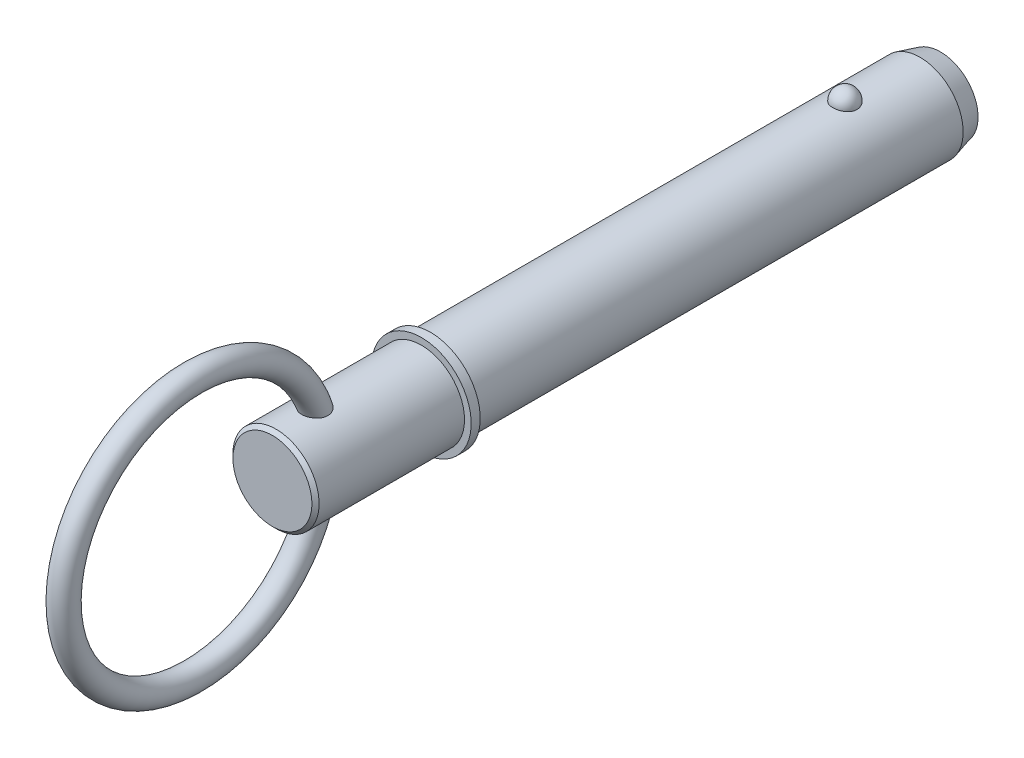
ISO-10303-21;
HEADER;
FILE_DESCRIPTION(('STEP AP214'),'2;1');
FILE_NAME('part.step','',(''),(''),'','','');
FILE_SCHEMA(('AUTOMOTIVE_DESIGN { 1 0 10303 214 1 1 1 1 }'));
ENDSEC;
DATA;
#1=APPLICATION_CONTEXT('core data for automotive mechanical design processes');
#2=APPLICATION_PROTOCOL_DEFINITION('international standard','automotive_design',2000,#1);
#3=PRODUCT_CONTEXT('',#1,'mechanical');
#4=PRODUCT('Part','Part','',(#3));
#5=PRODUCT_RELATED_PRODUCT_CATEGORY('part','',(#4));
#6=PRODUCT_DEFINITION_FORMATION('','',#4);
#7=PRODUCT_DEFINITION_CONTEXT('part definition',#1,'design');
#8=PRODUCT_DEFINITION('design','',#6,#7);
#9=PRODUCT_DEFINITION_SHAPE('','',#8);
#10=(LENGTH_UNIT() NAMED_UNIT(*) SI_UNIT(.MILLI.,.METRE.));
#11=(NAMED_UNIT(*) PLANE_ANGLE_UNIT() SI_UNIT($,.RADIAN.));
#12=(NAMED_UNIT(*) SI_UNIT($,.STERADIAN.) SOLID_ANGLE_UNIT());
#13=UNCERTAINTY_MEASURE_WITH_UNIT(LENGTH_MEASURE(1.E-05),#10,'distance_accuracy_value','');
#14=(GEOMETRIC_REPRESENTATION_CONTEXT(3) GLOBAL_UNCERTAINTY_ASSIGNED_CONTEXT((#13)) GLOBAL_UNIT_ASSIGNED_CONTEXT((#10,
#11,#12)) REPRESENTATION_CONTEXT('',''));
#15=CARTESIAN_POINT('',(0.,0.,0.));
#16=DIRECTION('',(0.,0.,1.));
#17=DIRECTION('',(1.,0.,0.));
#18=AXIS2_PLACEMENT_3D('',#15,#16,#17);
#19=CARTESIAN_POINT('',(0.,0.,88.9));
#20=DIRECTION('',(0.,0.,-1.));
#21=DIRECTION('',(-1.,0.,0.));
#22=AXIS2_PLACEMENT_3D('',#19,#20,#21);
#23=CYLINDRICAL_SURFACE('',#22,9.525);
#24=CARTESIAN_POINT('',(2.66304631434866,9.14515223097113,-2.69));
#25=CARTESIAN_POINT('',(2.66304388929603,9.14515434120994,-2.53964785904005));
#26=CARTESIAN_POINT('',(2.65079171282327,9.14874785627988,-2.389265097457));
#27=CARTESIAN_POINT('',(2.60207590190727,9.16272073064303,-2.09276319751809));
#28=CARTESIAN_POINT('',(2.5656035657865,9.17310252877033,-1.94664561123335));
#29=CARTESIAN_POINT('',(2.469373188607,9.19947238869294,-1.66290124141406));
#30=CARTESIAN_POINT('',(2.40962536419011,9.215457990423,-1.52527076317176));
#31=CARTESIAN_POINT('',(2.26832639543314,9.25124900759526,-1.26225231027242));
#32=CARTESIAN_POINT('',(2.1867756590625,9.27105435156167,-1.1368641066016));
#33=CARTESIAN_POINT('',(2.00344089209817,9.3123948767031,-0.901158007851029));
#34=CARTESIAN_POINT('',(1.90155748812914,9.33393823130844,-0.790918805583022));
#35=CARTESIAN_POINT('',(1.68043702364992,9.37626794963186,-0.589299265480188));
#36=CARTESIAN_POINT('',(1.56119995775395,9.397054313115,-0.497918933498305));
#37=CARTESIAN_POINT('',(1.30893044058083,9.43549335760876,-0.33681251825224));
#38=CARTESIAN_POINT('',(1.17593917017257,9.45315498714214,-0.267024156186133));
#39=CARTESIAN_POINT('',(0.8995966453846,9.48344056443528,-0.150749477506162));
#40=CARTESIAN_POINT('',(0.756246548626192,9.49606507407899,-0.104260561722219));
#41=CARTESIAN_POINT('',(0.466048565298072,9.51468193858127,-0.0365733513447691));
#42=CARTESIAN_POINT('',(0.319312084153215,9.52079100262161,-0.0149294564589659));
#43=CARTESIAN_POINT('',(0.0241592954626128,9.52611235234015,0.00395337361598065));
#44=CARTESIAN_POINT('',(-0.124256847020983,9.5253253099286,0.00119468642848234));
#45=CARTESIAN_POINT('',(-0.41628168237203,9.51700443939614,-0.0284230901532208));
#46=CARTESIAN_POINT('',(-0.559928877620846,9.50956858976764,-0.0549321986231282));
#47=CARTESIAN_POINT('',(-0.840604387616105,9.48887888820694,-0.130816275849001));
#48=CARTESIAN_POINT('',(-0.977632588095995,9.47562493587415,-0.180191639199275));
#49=CARTESIAN_POINT('',(-1.24212223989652,9.44460733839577,-0.300803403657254));
#50=CARTESIAN_POINT('',(-1.36952298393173,9.42681774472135,-0.372166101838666));
#51=CARTESIAN_POINT('',(-1.61053183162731,9.38864858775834,-0.53472901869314));
#52=CARTESIAN_POINT('',(-1.72413851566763,9.36826875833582,-0.625931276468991));
#53=CARTESIAN_POINT('',(-1.9367483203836,9.32666137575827,-0.827716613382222));
#54=CARTESIAN_POINT('',(-2.03542624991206,9.3054250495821,-0.93864062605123));
#55=CARTESIAN_POINT('',(-2.21301001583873,9.26480083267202,-1.17562728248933));
#56=CARTESIAN_POINT('',(-2.29191442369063,9.24541307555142,-1.30169101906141));
#57=CARTESIAN_POINT('',(-2.4288038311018,9.21040769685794,-1.56709947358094));
#58=CARTESIAN_POINT('',(-2.48653332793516,9.19483682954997,-1.7065822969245));
#59=CARTESIAN_POINT('',(-2.57830950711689,9.16952722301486,-1.9936348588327));
#60=CARTESIAN_POINT('',(-2.61235688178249,9.1597883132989,-2.14120436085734));
#61=CARTESIAN_POINT('',(-2.65582131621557,9.14728131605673,-2.43957517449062));
#62=CARTESIAN_POINT('',(-2.66534248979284,9.14448376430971,-2.59036007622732));
#63=CARTESIAN_POINT('',(-2.659816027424,9.1460926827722,-2.89143694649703));
#64=CARTESIAN_POINT('',(-2.64476907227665,9.15049895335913,-3.04172892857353));
#65=CARTESIAN_POINT('',(-2.59062526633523,9.16597303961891,-3.33676161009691));
#66=CARTESIAN_POINT('',(-2.55165119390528,9.17700684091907,-3.48152666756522));
#67=CARTESIAN_POINT('',(-2.45072334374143,9.20447158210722,-3.76226728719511));
#68=CARTESIAN_POINT('',(-2.38876863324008,9.22090274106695,-3.89824249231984));
#69=CARTESIAN_POINT('',(-2.24300082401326,9.25744165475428,-4.15838266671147));
#70=CARTESIAN_POINT('',(-2.15906901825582,9.27756919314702,-4.28247834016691));
#71=CARTESIAN_POINT('',(-1.97161008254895,9.31920445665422,-4.51460755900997));
#72=CARTESIAN_POINT('',(-1.86808218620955,9.34071223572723,-4.62264047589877));
#73=CARTESIAN_POINT('',(-1.64365852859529,9.38280712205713,-4.82005417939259));
#74=CARTESIAN_POINT('',(-1.52269814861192,9.40339041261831,-4.90936239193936));
#75=CARTESIAN_POINT('',(-1.26696810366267,9.44124442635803,-5.06628635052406));
#76=CARTESIAN_POINT('',(-1.13219941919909,9.45851538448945,-5.13390363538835));
#77=CARTESIAN_POINT('',(-0.854427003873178,9.48761400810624,-5.24478918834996));
#78=CARTESIAN_POINT('',(-0.711548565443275,9.49950757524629,-5.28835378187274));
#79=CARTESIAN_POINT('',(-0.420167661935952,9.51684639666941,-5.35116010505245));
#80=CARTESIAN_POINT('',(-0.271665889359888,9.52229244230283,-5.3704048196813));
#81=CARTESIAN_POINT('',(0.0236961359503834,9.52609381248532,-5.38387805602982));
#82=CARTESIAN_POINT('',(0.170533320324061,9.52458300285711,-5.37857884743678));
#83=CARTESIAN_POINT('',(0.461166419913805,9.51494050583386,-5.34419624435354));
#84=CARTESIAN_POINT('',(0.604962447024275,9.50680906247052,-5.31511372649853));
#85=CARTESIAN_POINT('',(0.884899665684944,9.48484202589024,-5.23415185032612));
#86=CARTESIAN_POINT('',(1.02106863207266,9.47102889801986,-5.18236222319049));
#87=CARTESIAN_POINT('',(1.28268503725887,9.43915933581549,-5.05742910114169));
#88=CARTESIAN_POINT('',(1.40813178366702,9.421102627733,-4.98428422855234));
#89=CARTESIAN_POINT('',(1.64690915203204,9.38233399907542,-4.81729201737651));
#90=CARTESIAN_POINT('',(1.76002050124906,9.36158508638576,-4.72313982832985));
#91=CARTESIAN_POINT('',(1.96897358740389,9.31987907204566,-4.5173244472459));
#92=CARTESIAN_POINT('',(2.06481234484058,9.29892193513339,-4.40565824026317));
#93=CARTESIAN_POINT('',(2.23837433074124,9.25869342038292,-4.16566572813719));
#94=CARTESIAN_POINT('',(2.31574652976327,9.23945848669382,-4.03707931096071));
#95=CARTESIAN_POINT('',(2.44818540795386,9.20525491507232,-3.76840633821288));
#96=CARTESIAN_POINT('',(2.50325979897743,9.19028480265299,-3.62832377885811));
#97=CARTESIAN_POINT('',(2.58510224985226,9.16757716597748,-3.35610038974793));
#98=CARTESIAN_POINT('',(2.61427951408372,9.15923447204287,-3.22472833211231));
#99=CARTESIAN_POINT('',(2.6532524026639,9.14802112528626,-2.95891229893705));
#100=CARTESIAN_POINT('',(2.66304848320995,9.1451503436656,-2.82446839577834));
#101=CARTESIAN_POINT('',(2.66304631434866,9.14515223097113,-2.69));
#102=B_SPLINE_CURVE_WITH_KNOTS('',3,(#24,#25,#26,#27,#28,#29,#30,#31,#32,#33,#34,#35,#36,#37,
#38,#39,#40,#41,#42,#43,#44,#45,#46,#47,#48,#49,#50,#51,#52,#53,#54,#55,#56,#57,#58,#59,#60,#61,
#62,#63,#64,#65,#66,#67,#68,#69,#70,#71,#72,#73,#74,#75,#76,#77,#78,#79,#80,#81,#82,#83,#84,#85,
#86,#87,#88,#89,#90,#91,#92,#93,#94,#95,#96,#97,#98,#99,#100,#101),.UNSPECIFIED.,.T.,.F.,(4,2,2,
2,2,2,2,2,2,2,2,2,2,2,2,2,2,2,2,2,2,2,2,2,2,2,2,2,2,2,2,2,2,2,2,2,2,2,4),(0.,0.450573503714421,
0.901308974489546,1.35184682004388,1.80237623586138,2.25516399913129,2.70795190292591,
3.15942136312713,3.61084044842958,4.0540301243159,4.49717661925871,4.9338984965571,
5.37062791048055,5.80991423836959,6.24924573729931,6.69708004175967,7.1449466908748,
7.5980522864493,8.0511446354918,8.50231041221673,8.95346368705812,9.40232106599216,
9.85119666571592,10.3025487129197,10.7539184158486,11.2070064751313,11.6600623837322,
12.1074045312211,12.5546917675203,12.9934085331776,13.4321091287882,13.8690915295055,
14.3061021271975,14.7499227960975,15.1938199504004,15.6455814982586,16.0971866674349,
16.5001694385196,16.9031427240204),.UNSPECIFIED.);
#103=CARTESIAN_POINT('',(2.66304631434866,9.14515223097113,-2.69));
#104=VERTEX_POINT('',#103);
#105=EDGE_CURVE('E101',#104,#104,#102,.T.);
#106=ORIENTED_EDGE('',*,*,#105,.T.);
#107=EDGE_LOOP('',(#106));
#108=FACE_BOUND('',#107,.T.);
#109=CARTESIAN_POINT('',(0.,0.,-19.2999999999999));
#110=DIRECTION('',(0.,0.,-1.));
#111=DIRECTION('',(-1.,0.,0.));
#112=AXIS2_PLACEMENT_3D('',#109,#110,#111);
#113=CIRCLE('',#112,9.525);
#114=CARTESIAN_POINT('',(-9.525,0.,-19.2999999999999));
#115=VERTEX_POINT('',#114);
#116=EDGE_CURVE('E109',#115,#115,#113,.F.);
#117=ORIENTED_EDGE('',*,*,#116,.T.);
#118=EDGE_LOOP('',(#117));
#119=FACE_BOUND('',#118,.T.);
#120=CARTESIAN_POINT('',(0.,0.,88.9));
#121=DIRECTION('',(0.,0.,1.));
#122=DIRECTION('',(1.,0.,0.));
#123=AXIS2_PLACEMENT_3D('',#120,#121,#122);
#124=CIRCLE('',#123,9.525);
#125=CARTESIAN_POINT('',(9.525,0.,88.9));
#126=VERTEX_POINT('',#125);
#127=EDGE_CURVE('E107',#126,#126,#124,.T.);
#128=ORIENTED_EDGE('',*,*,#127,.F.);
#129=EDGE_LOOP('',(#128));
#130=FACE_BOUND('',#129,.T.);
#131=ADVANCED_FACE('F39',(#108,#119,#130),#23,.T.);
#132=CARTESIAN_POINT('',(0.,0.,-23.8));
#133=DIRECTION('',(0.,0.,-1.));
#134=DIRECTION('',(-1.,0.,0.));
#135=AXIS2_PLACEMENT_3D('',#132,#133,#134);
#136=PLANE('',#135);
#137=CARTESIAN_POINT('',(0.,0.,-23.8));
#138=DIRECTION('',(0.,0.,-1.));
#139=DIRECTION('',(-1.,0.,0.));
#140=AXIS2_PLACEMENT_3D('',#137,#138,#139);
#141=CIRCLE('',#140,8.31922863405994);
#142=CARTESIAN_POINT('',(-8.31922863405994,0.,-23.8));
#143=VERTEX_POINT('',#142);
#144=EDGE_CURVE('E142',#143,#143,#141,.T.);
#145=ORIENTED_EDGE('',*,*,#144,.T.);
#146=EDGE_LOOP('',(#145));
#147=FACE_BOUND('',#146,.T.);
#148=ADVANCED_FACE('F87',(#147),#136,.T.);
#149=CARTESIAN_POINT('',(0.,0.,-23.8));
#150=DIRECTION('',(0.,0.,1.));
#151=DIRECTION('',(1.,0.,0.));
#152=AXIS2_PLACEMENT_3D('',#149,#150,#151);
#153=CONICAL_SURFACE('',#152,8.31922863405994,0.261799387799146);
#154=ORIENTED_EDGE('',*,*,#116,.F.);
#155=EDGE_LOOP('',(#154));
#156=FACE_BOUND('',#155,.T.);
#157=ORIENTED_EDGE('',*,*,#144,.F.);
#158=EDGE_LOOP('',(#157));
#159=FACE_BOUND('',#158,.T.);
#160=ADVANCED_FACE('F93',(#156,#159),#153,.T.);
#161=CARTESIAN_POINT('',(0.,9.525,-2.69));
#162=DIRECTION('',(0.,1.,0.));
#163=DIRECTION('',(0.,0.,1.));
#164=AXIS2_PLACEMENT_3D('',#161,#162,#163);
#165=SPHERICAL_SURFACE('',#164,2.69);
#166=ORIENTED_EDGE('',*,*,#105,.F.);
#167=EDGE_LOOP('',(#166));
#168=FACE_BOUND('',#167,.T.);
#169=ADVANCED_FACE('F112',(#168),#165,.T.);
#170=CARTESIAN_POINT('',(0.,0.,88.9));
#171=DIRECTION('',(0.,0.,-1.));
#172=DIRECTION('',(-1.,0.,0.));
#173=AXIS2_PLACEMENT_3D('',#170,#171,#172);
#174=PLANE('',#173);
#175=ORIENTED_EDGE('',*,*,#127,.T.);
#176=EDGE_LOOP('',(#175));
#177=FACE_BOUND('',#176,.T.);
#178=CARTESIAN_POINT('',(0.,0.,88.9));
#179=DIRECTION('',(0.,0.,-1.));
#180=DIRECTION('',(-1.,0.,0.));
#181=AXIS2_PLACEMENT_3D('',#178,#179,#180);
#182=CIRCLE('',#181,11.);
#183=CARTESIAN_POINT('',(-11.,0.,88.9));
#184=VERTEX_POINT('',#183);
#185=EDGE_CURVE('E108',#184,#184,#182,.T.);
#186=ORIENTED_EDGE('',*,*,#185,.T.);
#187=EDGE_LOOP('',(#186));
#188=FACE_BOUND('',#187,.T.);
#189=ADVANCED_FACE('F116',(#177,#188),#174,.T.);
#190=CARTESIAN_POINT('',(0.,0.,33.7287874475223));
#191=DIRECTION('',(0.,0.,-1.));
#192=DIRECTION('',(-1.,0.,0.));
#193=AXIS2_PLACEMENT_3D('',#190,#191,#192);
#194=CYLINDRICAL_SURFACE('',#193,11.);
#195=CARTESIAN_POINT('',(0.,0.,90.9));
#196=DIRECTION('',(0.,0.,-1.));
#197=DIRECTION('',(-1.,0.,0.));
#198=AXIS2_PLACEMENT_3D('',#195,#196,#197);
#199=CIRCLE('',#198,11.);
#200=CARTESIAN_POINT('',(-11.,0.,90.9));
#201=VERTEX_POINT('',#200);
#202=EDGE_CURVE('E133',#201,#201,#199,.T.);
#203=ORIENTED_EDGE('',*,*,#202,.T.);
#204=EDGE_LOOP('',(#203));
#205=FACE_BOUND('',#204,.T.);
#206=ORIENTED_EDGE('',*,*,#185,.F.);
#207=EDGE_LOOP('',(#206));
#208=FACE_BOUND('',#207,.T.);
#209=ADVANCED_FACE('F120',(#205,#208),#194,.T.);
#210=CARTESIAN_POINT('',(0.,11.,90.9));
#211=DIRECTION('',(0.,0.,1.));
#212=DIRECTION('',(1.,0.,0.));
#213=AXIS2_PLACEMENT_3D('',#210,#211,#212);
#214=PLANE('',#213);
#215=CARTESIAN_POINT('',(0.,0.,90.9));
#216=DIRECTION('',(0.,0.,1.));
#217=DIRECTION('',(1.,0.,0.));
#218=AXIS2_PLACEMENT_3D('',#215,#216,#217);
#219=CIRCLE('',#218,9.525);
#220=CARTESIAN_POINT('',(9.525,0.,90.9));
#221=VERTEX_POINT('',#220);
#222=EDGE_CURVE('E111',#221,#221,#219,.T.);
#223=ORIENTED_EDGE('',*,*,#222,.F.);
#224=EDGE_LOOP('',(#223));
#225=FACE_BOUND('',#224,.T.);
#226=ORIENTED_EDGE('',*,*,#202,.F.);
#227=EDGE_LOOP('',(#226));
#228=FACE_BOUND('',#227,.T.);
#229=ADVANCED_FACE('F84',(#225,#228),#214,.T.);
#230=CARTESIAN_POINT('',(0.,0.,123.83));
#231=DIRECTION('',(0.,0.,-1.));
#232=DIRECTION('',(-1.,0.,0.));
#233=AXIS2_PLACEMENT_3D('',#230,#231,#232);
#234=CYLINDRICAL_SURFACE('',#233,9.525);
#235=CARTESIAN_POINT('',(-1.17255022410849,-9.45255262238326,111.815681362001));
#236=CARTESIAN_POINT('',(-1.03279041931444,-9.46988901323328,111.752058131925));
#237=CARTESIAN_POINT('',(-0.887457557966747,-9.48474288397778,111.700036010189));
#238=CARTESIAN_POINT('',(-0.589790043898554,-9.50789357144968,111.620301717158));
#239=CARTESIAN_POINT('',(-0.437456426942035,-9.51619135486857,111.592585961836));
#240=CARTESIAN_POINT('',(-0.130095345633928,-9.52535230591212,111.562037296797));
#241=CARTESIAN_POINT('',(0.0249321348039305,-9.52621542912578,111.559204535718));
#242=CARTESIAN_POINT('',(0.333291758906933,-9.5204161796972,111.578480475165));
#243=CARTESIAN_POINT('',(0.486623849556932,-9.51375357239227,111.600589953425));
#244=CARTESIAN_POINT('',(0.787326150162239,-9.49360162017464,111.669309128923));
#245=CARTESIAN_POINT('',(0.934692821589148,-9.48010828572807,111.715933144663));
#246=CARTESIAN_POINT('',(1.2191706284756,-9.44773819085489,111.832695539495));
#247=CARTESIAN_POINT('',(1.35628163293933,-9.42886136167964,111.902834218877));
#248=CARTESIAN_POINT('',(1.61597534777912,-9.38783836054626,112.064858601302));
#249=CARTESIAN_POINT('',(1.73859309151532,-9.36570037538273,112.156690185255));
#250=CARTESIAN_POINT('',(1.96611924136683,-9.32059424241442,112.359983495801));
#251=CARTESIAN_POINT('',(2.07103000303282,-9.29762620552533,112.471442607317));
#252=CARTESIAN_POINT('',(2.25895856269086,-9.25375378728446,112.709567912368));
#253=CARTESIAN_POINT('',(2.34223089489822,-9.23282741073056,112.836029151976));
#254=CARTESIAN_POINT('',(2.48638570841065,-9.19505802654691,113.101654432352));
#255=CARTESIAN_POINT('',(2.54727152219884,-9.17821441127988,113.240816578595));
#256=CARTESIAN_POINT('',(2.64504150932,-9.15051673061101,113.526450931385));
#257=CARTESIAN_POINT('',(2.68213620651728,-9.13961026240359,113.67284631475));
#258=CARTESIAN_POINT('',(2.73308631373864,-9.1245038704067,113.969935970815));
#259=CARTESIAN_POINT('',(2.74693762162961,-9.12030513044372,114.120630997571));
#260=CARTESIAN_POINT('',(2.75225289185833,-9.11870262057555,114.428204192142));
#261=CARTESIAN_POINT('',(2.742835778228,-9.12156626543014,114.585097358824));
#262=CARTESIAN_POINT('',(2.70120500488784,-9.13397864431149,114.89553038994));
#263=CARTESIAN_POINT('',(2.66898313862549,-9.14352978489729,115.049069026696));
#264=CARTESIAN_POINT('',(2.57915721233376,-9.1692947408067,115.364317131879));
#265=CARTESIAN_POINT('',(2.5193838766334,-9.18606757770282,115.52536274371));
#266=CARTESIAN_POINT('',(2.37615490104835,-9.22415241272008,115.836112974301));
#267=CARTESIAN_POINT('',(2.29267648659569,-9.2454687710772,115.985806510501));
#268=CARTESIAN_POINT('',(2.09570343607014,-9.29218719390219,116.282005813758));
#269=CARTESIAN_POINT('',(1.98029238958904,-9.31778152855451,116.427215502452));
#270=CARTESIAN_POINT('',(1.72523060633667,-9.36835235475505,116.694631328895));
#271=CARTESIAN_POINT('',(1.58560973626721,-9.39332956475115,116.81686542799));
#272=CARTESIAN_POINT('',(1.31999418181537,-9.43381163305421,117.006542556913));
#273=CARTESIAN_POINT('',(1.1984987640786,-9.45016352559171,117.080111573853));
#274=CARTESIAN_POINT('',(0.944726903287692,-9.47889043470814,117.206555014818));
#275=CARTESIAN_POINT('',(0.812460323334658,-9.4912690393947,117.25944811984));
#276=CARTESIAN_POINT('',(0.539385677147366,-9.51070487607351,117.341579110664));
#277=CARTESIAN_POINT('',(0.398529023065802,-9.51772807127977,117.370665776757));
#278=CARTESIAN_POINT('',(0.113692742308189,-9.52538430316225,117.40234627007));
#279=CARTESIAN_POINT('',(-0.0302854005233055,-9.52602031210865,117.404952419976));
#280=CARTESIAN_POINT('',(-0.30106744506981,-9.52110324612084,117.384638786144));
#281=CARTESIAN_POINT('',(-0.428091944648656,-9.51619084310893,117.364361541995));
#282=CARTESIAN_POINT('',(-0.676960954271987,-9.50173118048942,117.303770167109));
#283=CARTESIAN_POINT('',(-0.798804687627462,-9.49218322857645,117.263453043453));
#284=CARTESIAN_POINT('',(-1.03743276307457,-9.4691126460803,117.163797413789));
#285=CARTESIAN_POINT('',(-1.15402581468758,-9.45550022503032,117.104026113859));
#286=CARTESIAN_POINT('',(-1.37707059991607,-9.42560278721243,116.968465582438));
#287=CARTESIAN_POINT('',(-1.48351822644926,-9.40931669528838,116.892669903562));
#288=CARTESIAN_POINT('',(-1.70022776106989,-9.37276249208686,116.715206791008));
#289=CARTESIAN_POINT('',(-1.80866644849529,-9.35226352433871,116.611363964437));
#290=CARTESIAN_POINT('',(-2.00947431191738,-9.31118474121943,116.38916467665));
#291=CARTESIAN_POINT('',(-2.1018320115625,-9.2906048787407,116.270797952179));
#292=CARTESIAN_POINT('',(-2.28343646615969,-9.24779116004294,116.001723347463));
#293=CARTESIAN_POINT('',(-2.36963977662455,-9.22584708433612,115.848904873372));
#294=CARTESIAN_POINT('',(-2.51731958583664,-9.18665215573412,115.531108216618));
#295=CARTESIAN_POINT('',(-2.57878214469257,-9.16940395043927,115.366123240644));
#296=CARTESIAN_POINT('',(-2.67771284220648,-9.14102404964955,115.017906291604));
#297=CARTESIAN_POINT('',(-2.71355979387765,-9.13031106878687,114.834171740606));
#298=CARTESIAN_POINT('',(-2.75239325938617,-9.11868499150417,114.462939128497));
#299=CARTESIAN_POINT('',(-2.75540326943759,-9.11776488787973,114.275443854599));
#300=CARTESIAN_POINT('',(-2.72755769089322,-9.12612848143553,113.918233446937));
#301=CARTESIAN_POINT('',(-2.69938579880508,-9.1346036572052,113.748293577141));
#302=CARTESIAN_POINT('',(-2.6128234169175,-9.15973790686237,113.41694195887));
#303=CARTESIAN_POINT('',(-2.55445306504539,-9.17639152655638,113.255524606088));
#304=CARTESIAN_POINT('',(-2.41575064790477,-9.21381352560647,112.962262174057));
#305=CARTESIAN_POINT('',(-2.33810564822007,-9.23402440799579,112.829067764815));
#306=CARTESIAN_POINT('',(-2.16110598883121,-9.27704240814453,112.578436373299));
#307=CARTESIAN_POINT('',(-2.06174995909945,-9.29984968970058,112.46100038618));
#308=CARTESIAN_POINT('',(-1.84046167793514,-9.34620233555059,112.241444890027));
#309=CARTESIAN_POINT('',(-1.71787459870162,-9.36974632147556,112.13998498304));
#310=CARTESIAN_POINT('',(-1.45637301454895,-9.41393415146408,111.960085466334));
#311=CARTESIAN_POINT('',(-1.31745717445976,-9.43457775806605,111.881647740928));
#312=CARTESIAN_POINT('',(-1.17255022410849,-9.45255262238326,111.815681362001));
#313=B_SPLINE_CURVE_WITH_KNOTS('',3,(#235,#236,#237,#238,#239,#240,#241,#242,#243,#244,#245,
#246,#247,#248,#249,#250,#251,#252,#253,#254,#255,#256,#257,#258,#259,#260,#261,#262,#263,#264,
#265,#266,#267,#268,#269,#270,#271,#272,#273,#274,#275,#276,#277,#278,#279,#280,#281,#282,#283,
#284,#285,#286,#287,#288,#289,#290,#291,#292,#293,#294,#295,#296,#297,#298,#299,#300,#301,#302,
#303,#304,#305,#306,#307,#308,#309,#310,#311,#312),.UNSPECIFIED.,.T.,.F.,(4,2,2,2,2,2,2,2,2,2,2,
2,2,2,2,2,2,2,2,2,2,2,2,2,2,2,2,2,2,2,2,2,2,2,2,2,2,2,4),(0.,0.463035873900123,
0.926003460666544,1.38897381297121,1.85195860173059,2.31521411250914,2.77847553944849,
3.24059321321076,3.70264936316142,4.15899535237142,4.61527338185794,5.06745604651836,
5.51971850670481,5.98936669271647,6.45918397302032,6.9748286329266,7.49097038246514,
8.04995658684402,8.60825803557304,9.03545685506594,9.46226879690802,9.89177127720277,
10.3210738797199,10.7054535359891,11.0898906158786,11.4835430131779,11.8773540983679,
12.3302409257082,12.7834496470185,13.3116493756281,13.8401462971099,14.3996817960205,
14.9588168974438,15.4733264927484,15.9874934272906,16.4516692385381,16.915874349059,
17.3959238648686,17.8760126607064),.UNSPECIFIED.);
#314=CARTESIAN_POINT('',(-1.17255022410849,-9.45255262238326,111.815681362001));
#315=VERTEX_POINT('',#314);
#316=EDGE_CURVE('E10',#315,#315,#313,.T.);
#317=ORIENTED_EDGE('',*,*,#316,.F.);
#318=EDGE_LOOP('',(#317));
#319=FACE_BOUND('',#318,.T.);
#320=CARTESIAN_POINT('',(-1.17255022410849,9.45255262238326,111.815681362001));
#321=CARTESIAN_POINT('',(-1.31058061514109,9.43543238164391,111.878514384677));
#322=CARTESIAN_POINT('',(-1.44315063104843,9.41589375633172,111.952651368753));
#323=CARTESIAN_POINT('',(-1.69365345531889,9.37407591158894,112.121892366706));
#324=CARTESIAN_POINT('',(-1.81158925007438,9.35179725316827,112.216992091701));
#325=CARTESIAN_POINT('',(-2.02956633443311,9.30692788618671,112.42596768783));
#326=CARTESIAN_POINT('',(-2.12959463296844,9.28433696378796,112.539857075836));
#327=CARTESIAN_POINT('',(-2.30883055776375,9.24139869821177,112.78334578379));
#328=CARTESIAN_POINT('',(-2.38804080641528,9.22105107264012,112.912943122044));
#329=CARTESIAN_POINT('',(-2.52289811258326,9.18506690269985,113.182637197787));
#330=CARTESIAN_POINT('',(-2.57879510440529,9.16938093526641,113.322602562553));
#331=CARTESIAN_POINT('',(-2.66732862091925,9.14402087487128,113.610194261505));
#332=CARTESIAN_POINT('',(-2.6999643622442,9.13434698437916,113.757820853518));
#333=CARTESIAN_POINT('',(-2.74234854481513,9.12171311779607,114.058709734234));
#334=CARTESIAN_POINT('',(-2.75176419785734,9.11885078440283,114.212022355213));
#335=CARTESIAN_POINT('',(-2.74768995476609,9.12007747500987,114.518282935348));
#336=CARTESIAN_POINT('',(-2.73419331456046,9.12416854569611,114.671230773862));
#337=CARTESIAN_POINT('',(-2.68381401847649,9.13911977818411,114.985048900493));
#338=CARTESIAN_POINT('',(-2.64520186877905,9.15047943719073,115.145615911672));
#339=CARTESIAN_POINT('',(-2.54485320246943,9.17889121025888,115.458878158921));
#340=CARTESIAN_POINT('',(-2.48309922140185,9.19594762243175,115.611567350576));
#341=CARTESIAN_POINT('',(-2.33056913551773,9.23584987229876,115.921122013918));
#342=CARTESIAN_POINT('',(-2.23745101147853,9.25911216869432,116.076784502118));
#343=CARTESIAN_POINT('',(-2.02674425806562,9.307501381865,116.370279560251));
#344=CARTESIAN_POINT('',(-1.90916388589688,9.33262766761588,116.508118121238));
#345=CARTESIAN_POINT('',(-1.67044606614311,9.37804498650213,116.742015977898));
#346=CARTESIAN_POINT('',(-1.55243875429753,9.39849934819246,116.841240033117));
#347=CARTESIAN_POINT('',(-1.30125310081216,9.43654625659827,117.019193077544));
#348=CARTESIAN_POINT('',(-1.16808326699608,9.45414039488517,117.097933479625));
#349=CARTESIAN_POINT('',(-0.958516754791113,9.47691412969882,117.197606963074));
#350=CARTESIAN_POINT('',(-0.886649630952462,9.48392776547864,117.227860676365));
#351=CARTESIAN_POINT('',(-0.740281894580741,9.49647248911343,117.281484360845));
#352=CARTESIAN_POINT('',(-0.665782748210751,9.50200438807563,117.304858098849));
#353=CARTESIAN_POINT('',(-0.514804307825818,9.51137811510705,117.3442294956));
#354=CARTESIAN_POINT('',(-0.438326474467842,9.51522115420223,117.360232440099));
#355=CARTESIAN_POINT('',(-0.284116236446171,9.52107513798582,117.384532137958));
#356=CARTESIAN_POINT('',(-0.206384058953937,9.52308641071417,117.392830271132));
#357=CARTESIAN_POINT('',(0.00463957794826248,9.5259225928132,117.40454519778));
#358=CARTESIAN_POINT('',(0.138460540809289,9.52491109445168,117.400394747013));
#359=CARTESIAN_POINT('',(0.403152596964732,9.51738801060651,117.369251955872));
#360=CARTESIAN_POINT('',(0.534023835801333,9.51087669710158,117.342260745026));
#361=CARTESIAN_POINT('',(0.783985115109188,9.49347484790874,117.268806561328));
#362=CARTESIAN_POINT('',(0.903337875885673,9.48277338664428,117.223181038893));
#363=CARTESIAN_POINT('',(1.13363663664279,9.45800893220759,117.114928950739));
#364=CARTESIAN_POINT('',(1.24458027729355,9.44394500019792,117.052297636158));
#365=CARTESIAN_POINT('',(1.46880911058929,9.41182796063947,116.904389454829));
#366=CARTESIAN_POINT('',(1.58087386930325,9.3935013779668,116.817328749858));
#367=CARTESIAN_POINT('',(1.79132420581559,9.35565274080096,116.628247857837));
#368=CARTESIAN_POINT('',(1.88970126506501,9.33612995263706,116.526218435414));
#369=CARTESIAN_POINT('',(2.08778125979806,9.29401761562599,116.290997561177));
#370=CARTESIAN_POINT('',(2.18473298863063,9.27148591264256,116.15547341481));
#371=CARTESIAN_POINT('',(2.35733954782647,9.22911075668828,115.871030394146));
#372=CARTESIAN_POINT('',(2.43297838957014,9.20926932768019,115.722101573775));
#373=CARTESIAN_POINT('',(2.56843139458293,9.17247322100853,115.397269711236));
#374=CARTESIAN_POINT('',(2.6256192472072,9.15606955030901,115.220196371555));
#375=CARTESIAN_POINT('',(2.70930664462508,9.13166037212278,114.858330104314));
#376=CARTESIAN_POINT('',(2.73581406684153,9.12365270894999,114.673539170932));
#377=CARTESIAN_POINT('',(2.7551261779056,9.11784049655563,114.309017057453));
#378=CARTESIAN_POINT('',(2.74917791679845,9.11965839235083,114.129361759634));
#379=CARTESIAN_POINT('',(2.70473277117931,9.13294027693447,113.774499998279));
#380=CARTESIAN_POINT('',(2.66626406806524,9.14439591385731,113.599289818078));
#381=CARTESIAN_POINT('',(2.56263844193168,9.17393184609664,113.278469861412));
#382=CARTESIAN_POINT('',(2.50080069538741,9.19116614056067,113.131704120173));
#383=CARTESIAN_POINT('',(2.3524484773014,9.23024728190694,112.85189992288));
#384=CARTESIAN_POINT('',(2.26593972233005,9.25209305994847,112.718858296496));
#385=CARTESIAN_POINT('',(2.07585352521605,9.29652853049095,112.477145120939));
#386=CARTESIAN_POINT('',(1.97340753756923,9.31901931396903,112.367562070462));
#387=CARTESIAN_POINT('',(1.75142335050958,9.36327537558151,112.167179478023));
#388=CARTESIAN_POINT('',(1.63188535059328,9.38504066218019,112.076379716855));
#389=CARTESIAN_POINT('',(1.37826267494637,9.42563474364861,111.915168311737));
#390=CARTESIAN_POINT('',(1.24409194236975,9.44444438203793,111.844887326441));
#391=CARTESIAN_POINT('',(0.965562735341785,9.47697010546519,111.726996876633));
#392=CARTESIAN_POINT('',(0.821203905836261,9.4906860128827,111.679388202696));
#393=CARTESIAN_POINT('',(0.524366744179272,9.51173338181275,111.607369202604));
#394=CARTESIAN_POINT('',(0.37180751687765,9.5189799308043,111.583267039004));
#395=CARTESIAN_POINT('',(0.064611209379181,9.52602042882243,111.559842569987));
#396=CARTESIAN_POINT('',(-0.0900262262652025,9.52581308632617,111.560524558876));
#397=CARTESIAN_POINT('',(-0.404139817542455,9.51777767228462,111.587276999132));
#398=CARTESIAN_POINT('',(-0.563508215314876,9.50959696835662,111.614522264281));
#399=CARTESIAN_POINT('',(-0.874799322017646,9.48602809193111,111.695533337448));
#400=CARTESIAN_POINT('',(-1.02672214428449,9.47064002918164,111.74929874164));
#401=CARTESIAN_POINT('',(-1.17255022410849,9.45255262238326,111.815681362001));
#402=B_SPLINE_CURVE_WITH_KNOTS('',3,(#320,#321,#322,#323,#324,#325,#326,#327,#328,#329,#330,
#331,#332,#333,#334,#335,#336,#337,#338,#339,#340,#341,#342,#343,#344,#345,#346,#347,#348,#349,
#350,#351,#352,#353,#354,#355,#356,#357,#358,#359,#360,#361,#362,#363,#364,#365,#366,#367,#368,
#369,#370,#371,#372,#373,#374,#375,#376,#377,#378,#379,#380,#381,#382,#383,#384,#385,#386,#387,
#388,#389,#390,#391,#392,#393,#394,#395,#396,#397,#398,#399,#400,#401),.UNSPECIFIED.,.T.,.F.,(4,
2,2,2,2,2,2,2,2,2,2,2,2,2,2,2,2,2,2,2,2,2,2,2,2,2,2,2,2,2,2,2,2,2,2,2,2,2,2,2,4),(0.,
0.457306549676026,0.914519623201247,1.37206305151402,1.82954881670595,2.28199545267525,
2.73445732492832,3.19336710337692,3.65241198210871,4.14699278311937,4.64194758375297,
5.18812269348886,5.73411374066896,6.19889752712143,6.66342179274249,6.89799214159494,
7.1324338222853,7.36670711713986,7.60093844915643,8.00032434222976,8.39969048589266,
8.78279802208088,9.16601265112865,9.59366701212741,10.0215863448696,10.5240084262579,
11.0268064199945,11.5844522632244,12.1419548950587,12.6781910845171,13.213963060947,
13.6920531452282,14.1700325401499,14.6229745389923,15.0759112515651,15.5316722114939,
15.9874490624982,16.4491237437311,16.9108784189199,17.3940267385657,17.8771677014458),.UNSPECIFIED.);
#403=CARTESIAN_POINT('',(-1.17255022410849,9.45255262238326,111.815681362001));
#404=VERTEX_POINT('',#403);
#405=EDGE_CURVE('E51',#404,#404,#402,.T.);
#406=ORIENTED_EDGE('',*,*,#405,.F.);
#407=EDGE_LOOP('',(#406));
#408=FACE_BOUND('',#407,.T.);
#409=CARTESIAN_POINT('',(0.,0.,123.03));
#410=DIRECTION('',(0.,0.,-1.));
#411=DIRECTION('',(-1.,0.,0.));
#412=AXIS2_PLACEMENT_3D('',#409,#410,#411);
#413=CIRCLE('',#412,9.525);
#414=CARTESIAN_POINT('',(-9.525,0.,123.03));
#415=VERTEX_POINT('',#414);
#416=EDGE_CURVE('E63',#415,#415,#413,.T.);
#417=ORIENTED_EDGE('',*,*,#416,.T.);
#418=EDGE_LOOP('',(#417));
#419=FACE_BOUND('',#418,.T.);
#420=ORIENTED_EDGE('',*,*,#222,.T.);
#421=EDGE_LOOP('',(#420));
#422=FACE_BOUND('',#421,.T.);
#423=ADVANCED_FACE('F68',(#319,#408,#419,#422),#234,.T.);
#424=CARTESIAN_POINT('',(0.,0.,123.83));
#425=DIRECTION('',(0.,0.,-1.));
#426=DIRECTION('',(-1.,0.,0.));
#427=AXIS2_PLACEMENT_3D('',#424,#425,#426);
#428=PLANE('',#427);
#429=CARTESIAN_POINT('',(0.,0.,123.83));
#430=DIRECTION('',(0.,0.,-1.));
#431=DIRECTION('',(-1.,0.,0.));
#432=AXIS2_PLACEMENT_3D('',#429,#430,#431);
#433=CIRCLE('',#432,8.725);
#434=CARTESIAN_POINT('',(-8.725,0.,123.83));
#435=VERTEX_POINT('',#434);
#436=EDGE_CURVE('E57',#435,#435,#433,.F.);
#437=ORIENTED_EDGE('',*,*,#436,.T.);
#438=EDGE_LOOP('',(#437));
#439=FACE_BOUND('',#438,.T.);
#440=ADVANCED_FACE('F75',(#439),#428,.F.);
#441=CARTESIAN_POINT('',(0.,0.,123.03));
#442=DIRECTION('',(0.,0.,-1.));
#443=DIRECTION('',(-1.,0.,0.));
#444=AXIS2_PLACEMENT_3D('',#441,#442,#443);
#445=CONICAL_SURFACE('',#444,9.525,0.785398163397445);
#446=ORIENTED_EDGE('',*,*,#436,.F.);
#447=EDGE_LOOP('',(#446));
#448=FACE_BOUND('',#447,.T.);
#449=ORIENTED_EDGE('',*,*,#416,.F.);
#450=EDGE_LOOP('',(#449));
#451=FACE_BOUND('',#450,.T.);
#452=ADVANCED_FACE('F41',(#448,#451),#445,.T.);
#453=CARTESIAN_POINT('',(0.,0.,141.405));
#454=DIRECTION('',(1.,0.,0.));
#455=DIRECTION('',(0.,0.,-1.));
#456=AXIS2_PLACEMENT_3D('',#453,#454,#455);
#457=TOROIDAL_SURFACE('',#456,28.575,2.75);
#458=ORIENTED_EDGE('',*,*,#316,.T.);
#459=EDGE_LOOP('',(#458));
#460=FACE_BOUND('',#459,.T.);
#461=ORIENTED_EDGE('',*,*,#405,.T.);
#462=EDGE_LOOP('',(#461));
#463=FACE_BOUND('',#462,.T.);
#464=ADVANCED_FACE('F72',(#460,#463),#457,.T.);
#465=CLOSED_SHELL('',(#131,#148,#160,#169,#189,#209,#229,#423,#440,#452,#464));
#466=MANIFOLD_SOLID_BREP('B2',#465);
#467=ADVANCED_BREP_SHAPE_REPRESENTATION('',(#18,#466),#14);
#468=SHAPE_DEFINITION_REPRESENTATION(#9,#467);
ENDSEC;
END-ISO-10303-21;
